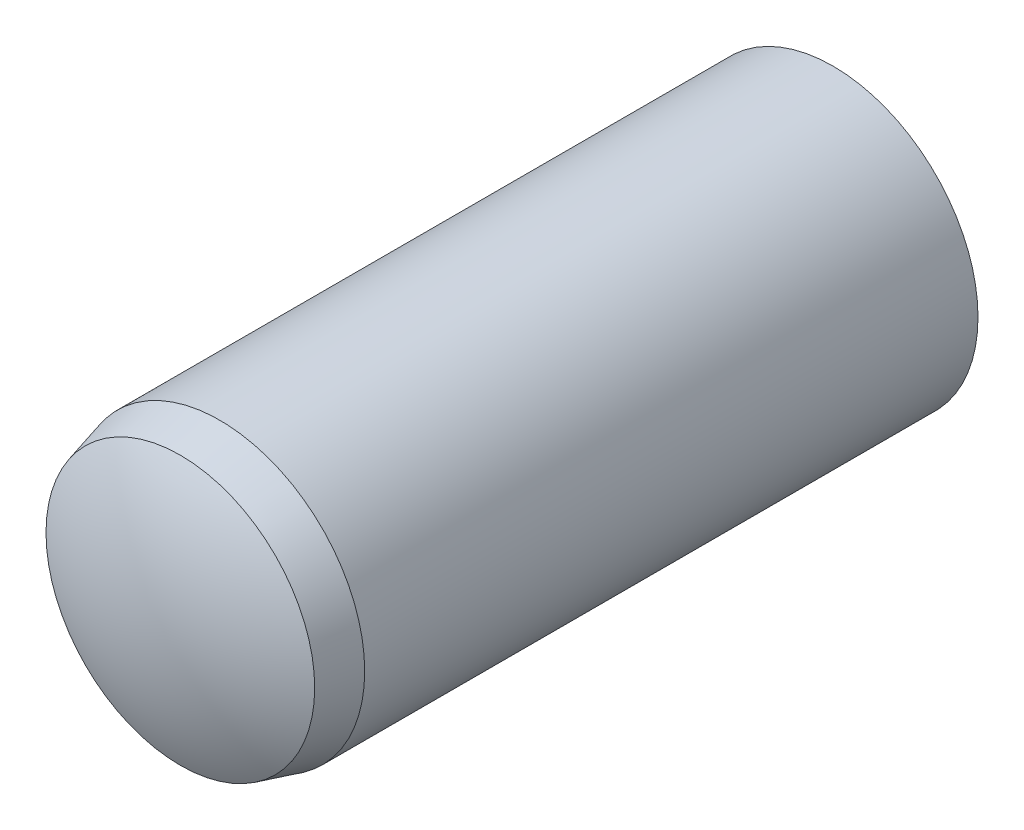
ISO-10303-21;
HEADER;
FILE_DESCRIPTION(('STEP AP214'),'2;1');
FILE_NAME('part.step','',(''),(''),'','','');
FILE_SCHEMA(('AUTOMOTIVE_DESIGN { 1 0 10303 214 1 1 1 1 }'));
ENDSEC;
DATA;
#1=APPLICATION_CONTEXT('core data for automotive mechanical design processes');
#2=APPLICATION_PROTOCOL_DEFINITION('international standard','automotive_design',2000,#1);
#3=PRODUCT_CONTEXT('',#1,'mechanical');
#4=PRODUCT('Part','Part','',(#3));
#5=PRODUCT_RELATED_PRODUCT_CATEGORY('part','',(#4));
#6=PRODUCT_DEFINITION_FORMATION('','',#4);
#7=PRODUCT_DEFINITION_CONTEXT('part definition',#1,'design');
#8=PRODUCT_DEFINITION('design','',#6,#7);
#9=PRODUCT_DEFINITION_SHAPE('','',#8);
#10=(LENGTH_UNIT() NAMED_UNIT(*) SI_UNIT(.MILLI.,.METRE.));
#11=(NAMED_UNIT(*) PLANE_ANGLE_UNIT() SI_UNIT($,.RADIAN.));
#12=(NAMED_UNIT(*) SI_UNIT($,.STERADIAN.) SOLID_ANGLE_UNIT());
#13=UNCERTAINTY_MEASURE_WITH_UNIT(LENGTH_MEASURE(1.E-05),#10,'distance_accuracy_value','');
#14=(GEOMETRIC_REPRESENTATION_CONTEXT(3) GLOBAL_UNCERTAINTY_ASSIGNED_CONTEXT((#13)) GLOBAL_UNIT_ASSIGNED_CONTEXT((#10,
#11,#12)) REPRESENTATION_CONTEXT('',''));
#15=CARTESIAN_POINT('',(0.,0.,0.));
#16=DIRECTION('',(0.,0.,1.));
#17=DIRECTION('',(1.,0.,0.));
#18=AXIS2_PLACEMENT_3D('',#15,#16,#17);
#19=CARTESIAN_POINT('',(0.,0.,6.));
#20=DIRECTION('',(0.,0.,1.));
#21=DIRECTION('',(0.,1.,0.));
#22=AXIS2_PLACEMENT_3D('',#19,#20,#21);
#23=SPHERICAL_SURFACE('',#22,4.);
#24=CARTESIAN_POINT('',(0.,0.,9.5443075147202));
#25=DIRECTION('',(0.,0.,1.));
#26=DIRECTION('',(1.,0.,0.));
#27=AXIS2_PLACEMENT_3D('',#24,#25,#26);
#28=CIRCLE('',#27,1.85415324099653);
#29=CARTESIAN_POINT('',(1.85415324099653,0.,9.5443075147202));
#30=VERTEX_POINT('',#29);
#31=EDGE_CURVE('E42',#30,#30,#28,.T.);
#32=ORIENTED_EDGE('',*,*,#31,.T.);
#33=EDGE_LOOP('',(#32));
#34=FACE_BOUND('',#33,.T.);
#35=ADVANCED_FACE('F32',(#34),#23,.T.);
#36=CARTESIAN_POINT('',(0.,0.,4.));
#37=DIRECTION('',(0.,0.,1.));
#38=DIRECTION('',(0.,1.,0.));
#39=AXIS2_PLACEMENT_3D('',#36,#37,#38);
#40=SPHERICAL_SURFACE('',#39,4.);
#41=CARTESIAN_POINT('',(0.,0.,0.535898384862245));
#42=DIRECTION('',(0.,0.,1.));
#43=DIRECTION('',(1.,0.,0.));
#44=AXIS2_PLACEMENT_3D('',#41,#42,#43);
#45=CIRCLE('',#44,2.);
#46=CARTESIAN_POINT('',(2.,0.,0.535898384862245));
#47=VERTEX_POINT('',#46);
#48=EDGE_CURVE('E10',#47,#47,#45,.T.);
#49=ORIENTED_EDGE('',*,*,#48,.F.);
#50=EDGE_LOOP('',(#49));
#51=FACE_BOUND('',#50,.T.);
#52=ADVANCED_FACE('F57',(#51),#40,.T.);
#53=CARTESIAN_POINT('',(0.,0.,0.));
#54=DIRECTION('',(0.,0.,1.));
#55=DIRECTION('',(1.,0.,0.));
#56=AXIS2_PLACEMENT_3D('',#53,#54,#55);
#57=CYLINDRICAL_SURFACE('',#56,2.);
#58=CARTESIAN_POINT('',(0.,0.,9.));
#59=DIRECTION('',(0.,0.,1.));
#60=DIRECTION('',(1.,0.,0.));
#61=AXIS2_PLACEMENT_3D('',#58,#59,#60);
#62=CIRCLE('',#61,2.);
#63=CARTESIAN_POINT('',(2.,0.,9.));
#64=VERTEX_POINT('',#63);
#65=EDGE_CURVE('E38',#64,#64,#62,.T.);
#66=ORIENTED_EDGE('',*,*,#65,.F.);
#67=EDGE_LOOP('',(#66));
#68=FACE_BOUND('',#67,.T.);
#69=ORIENTED_EDGE('',*,*,#48,.T.);
#70=EDGE_LOOP('',(#69));
#71=FACE_BOUND('',#70,.T.);
#72=ADVANCED_FACE('F52',(#68,#71),#57,.T.);
#73=CARTESIAN_POINT('',(0.,0.,9.));
#74=DIRECTION('',(0.,0.,-1.));
#75=DIRECTION('',(-1.,0.,0.));
#76=AXIS2_PLACEMENT_3D('',#73,#74,#75);
#77=CONICAL_SURFACE('',#76,2.,0.261799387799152);
#78=ORIENTED_EDGE('',*,*,#31,.F.);
#79=EDGE_LOOP('',(#78));
#80=FACE_BOUND('',#79,.T.);
#81=ORIENTED_EDGE('',*,*,#65,.T.);
#82=EDGE_LOOP('',(#81));
#83=FACE_BOUND('',#82,.T.);
#84=ADVANCED_FACE('F50',(#80,#83),#77,.T.);
#85=CLOSED_SHELL('',(#35,#52,#72,#84));
#86=MANIFOLD_SOLID_BREP('B2',#85);
#87=ADVANCED_BREP_SHAPE_REPRESENTATION('',(#18,#86),#14);
#88=SHAPE_DEFINITION_REPRESENTATION(#9,#87);
ENDSEC;
END-ISO-10303-21;
